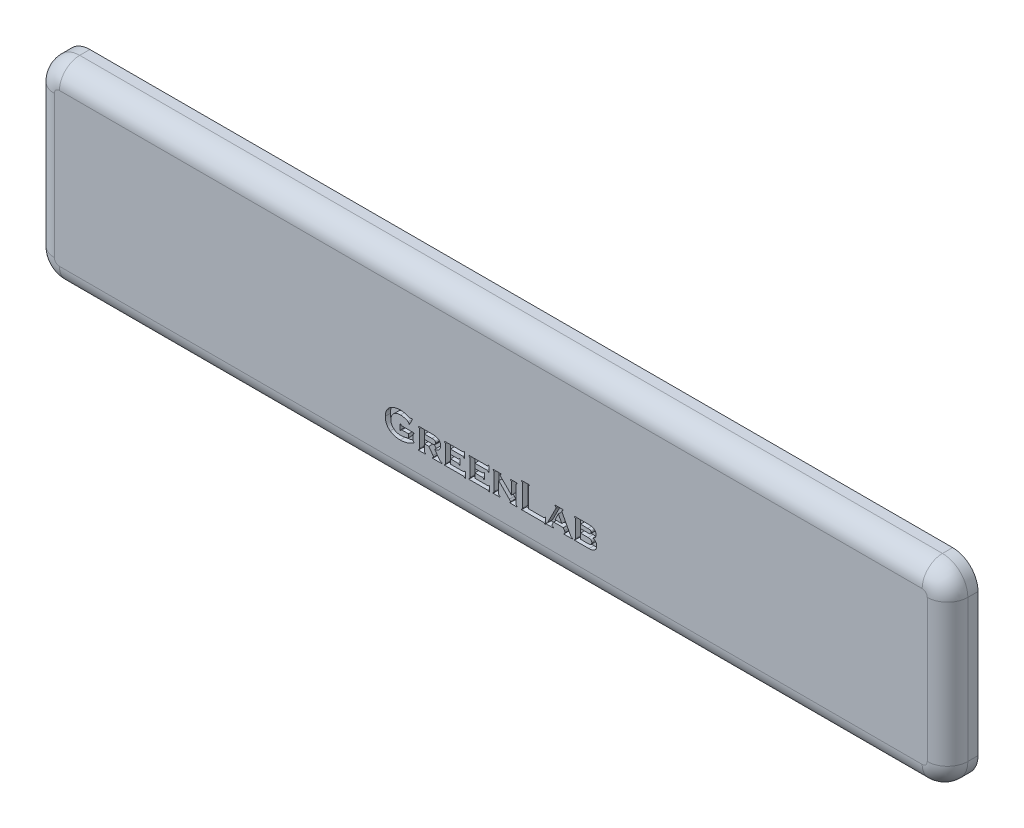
from build123d import *

# Parameters (mm, degrees)
SKETCH1_W           = 90
SKETCH1_H           = 19
BOSS_EXTRUDE1_DEPTH = 3
FILLET1_R           = 2.5
FILLET2_R           = 2
CUT_EXTRUDE1_DEPTH  = 0.5


with BuildPart() as part:
    # Sketch1 → Boss-Extrude1 (new body)
    with BuildSketch(Plane.XY.offset(3)):
        with Locations((11, 0)):
            Rectangle(SKETCH1_W, SKETCH1_H)
    extrude(amount=-BOSS_EXTRUDE1_DEPTH)

    # Fillet1
    fillet1_edges = [part.edges().sort_by_distance(p)[0] for p in [
        (-34, 9.5, 1.5),
        (56, 9.5, 1.5),
        (56, -9.5, 1.5),
        (-34, -9.5, 1.5),
    ]]
    fillet(fillet1_edges, radius=FILLET1_R)

    # Fillet2
    fillet2_edges = [part.edges().sort_by_distance(p)[0] for p in [
        (56, 0, 3),
        (-34, 0, 3),
        (11, -9.5, 3),
        (11, 9.5, 3),
        (-33.267766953, -8.767766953, 3),
        (-33.267766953, 8.767766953, 3),
        (55.267766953, -8.767766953, 3),
        (55.267766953, 8.767766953, 3),
    ]]
    fillet(fillet2_edges, radius=FILLET2_R)

    # Sketch2 → Cut-Extrude1 (cut)
    # profile 1 of 8: a face of its own
    with BuildSketch(Plane.XY.offset(3)):
        with BuildLine():
            Line((2.892361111, -4.597222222), (2.263020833, -4.597222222))
            add(Edge.make_bspline(
                [(2.263020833, -4.597222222), (2.253980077, -4.597634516), (2.236897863, -4.59841353), (2.212652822, -4.60149615), (2.192508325, -4.609463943), (2.175040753, -4.619292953), (2.161109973, -4.63393915), (2.148530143, -4.652230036), (2.137222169, -4.675071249), (2.13150657, -4.692262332), (2.128472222, -4.701388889)],
                knots=[0, 0, 0, 0, 1.161951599, 2.195469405, 3.113157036, 3.92473158, 4.744880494, 5.677977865, 6.767264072, 8, 8, 8, 8], degree=3))
            Line((2.128472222, -4.701388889), (2.059027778, -4.701388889))
            Line((2.059027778, -4.701388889), (2.059027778, -4.145833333))
            Line((2.059027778, -4.145833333), (2.128472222, -4.145833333))
            add(Edge.make_bspline(
                [(2.128472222, -4.145833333), (2.131455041, -4.155168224), (2.13702767, -4.172608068), (2.148829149, -4.195397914), (2.16035132, -4.21444602), (2.174333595, -4.228851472), (2.191430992, -4.238338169), (2.211127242, -4.24558164), (2.234709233, -4.248858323), (2.25144255, -4.249604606), (2.26030816, -4.25)],
                knots=[0, 0, 0, 0, 1.267174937, 2.367390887, 3.316236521, 4.144614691, 4.932227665, 5.829021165, 6.8497767, 8, 8, 8, 8], degree=3))
            Line((2.26030816, -4.25), (3.447916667, -4.25))
            Line((3.447916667, -4.25), (3.447916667, -4.319444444))
            add(Edge.make_bspline(
                [(3.447916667, -4.319444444), (3.438958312, -4.322276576), (3.422120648, -4.327599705), (3.399742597, -4.338767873), (3.381037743, -4.350221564), (3.366701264, -4.363946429), (3.355806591, -4.379700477), (3.349088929, -4.39859326), (3.344582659, -4.420325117), (3.344040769, -4.435880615), (3.34375, -4.444227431)],
                knots=[0, 0, 0, 0, 1.261989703, 2.371971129, 3.357346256, 4.200586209, 5.023932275, 5.909634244, 6.878345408, 8, 8, 8, 8], degree=3))
            Line((3.34375, -4.444227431), (3.34375, -4.923828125))
            add(Edge.make_bspline(
                [(3.34375, -4.923828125), (3.344110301, -4.932161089), (3.344780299, -4.947656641), (3.348455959, -4.969691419), (3.355267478, -4.988581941), (3.365562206, -5.004788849), (3.379855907, -5.01839035), (3.398945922, -5.029314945), (3.421581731, -5.040471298), (3.438775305, -5.045785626), (3.447916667, -5.048611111)],
                knots=[0, 0, 0, 0, 1.116533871, 2.076248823, 2.980572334, 3.786808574, 4.626198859, 5.59413096, 6.720864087, 8, 8, 8, 8], degree=3))
            Line((3.447916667, -5.048611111), (3.447916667, -5.118055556))
            add(Edge.make_bspline(
                [(3.447916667, -5.118055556), (3.389333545, -5.151306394), (3.274179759, -5.216665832), (3.097911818, -5.301148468), (2.9231664, -5.373083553), (2.749782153, -5.431933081), (2.577820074, -5.47792273), (2.407208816, -5.51040836), (2.237842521, -5.530912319), (2.125273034, -5.533457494), (2.069335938, -5.534722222)],
                knots=[0, 0, 0, 0, 1.109239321, 2.180373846, 3.216973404, 4.220153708, 5.194106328, 6.146335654, 7.078892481, 8, 8, 8, 8], degree=3))
            add(Edge.make_bspline(
                [(2.069335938, -5.534722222), (2.019929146, -5.533992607), (1.923451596, -5.532567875), (1.782287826, -5.51841923), (1.647967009, -5.496781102), (1.520801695, -5.464926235), (1.399922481, -5.425751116), (1.286620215, -5.37610841), (1.179736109, -5.318197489), (1.114070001, -5.272231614), (1.081380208, -5.249348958)],
                knots=[0, 0, 0, 0, 1.133031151, 2.212490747, 3.251195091, 4.25132316, 5.216867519, 6.162529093, 7.085273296, 8, 8, 8, 8], degree=3))
            add(Edge.make_bspline(
                [(1.081380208, -5.249348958), (1.061875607, -5.234168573), (1.023156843, -5.204033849), (0.968372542, -5.155928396), (0.917838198, -5.105026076), (0.870449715, -5.052718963), (0.82740661, -4.997401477), (0.788026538, -4.940094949), (0.751828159, -4.880940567), (0.720575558, -4.819179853), (0.69202152, -4.755624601), (0.667821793, -4.689559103), (0.647270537, -4.621389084), (0.629525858, -4.551271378), (0.616815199, -4.478693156), (0.607739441, -4.403891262), (0.601320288, -4.327151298), (0.600904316, -4.275150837), (0.600694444, -4.248914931)],
                knots=[0, 0, 0, 0, 1.027594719, 2.039887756, 3.02889878, 4.008719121, 4.97294883, 5.940778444, 6.898978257, 7.854104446, 8.816896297, 9.794723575, 10.777166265, 11.776613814, 12.800294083, 13.838400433, 14.909403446, 16, 16, 16, 16], degree=3))
            add(Edge.make_bspline(
                [(0.600694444, -4.248914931), (0.601836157, -4.200375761), (0.604066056, -4.105573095), (0.624688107, -3.9671466), (0.658277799, -3.83638671), (0.704809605, -3.712858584), (0.765875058, -3.597529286), (0.839325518, -3.489470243), (0.926804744, -3.389056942), (0.994039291, -3.330025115), (1.028211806, -3.300021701)],
                knots=[0, 0, 0, 0, 1.080618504, 2.110574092, 3.109061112, 4.08310081, 5.043468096, 6.008781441, 6.987946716, 8, 8, 8, 8], degree=3))
            add(Edge.make_bspline(
                [(1.028211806, -3.300021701), (1.062730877, -3.272989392), (1.132080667, -3.218680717), (1.247213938, -3.151429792), (1.369864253, -3.093483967), (1.501041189, -3.046312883), (1.640572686, -3.010151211), (1.788247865, -2.984311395), (1.944201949, -2.968332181), (2.051031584, -2.96631154), (2.105685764, -2.965277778)],
                knots=[0, 0, 0, 0, 0.913103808, 1.834451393, 2.772129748, 3.738097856, 4.735733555, 5.773315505, 6.860825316, 8, 8, 8, 8], degree=3))
            add(Edge.make_bspline(
                [(2.105685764, -2.965277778), (2.140778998, -2.965887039), (2.209950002, -2.967087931), (2.312133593, -2.973951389), (2.411161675, -2.986602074), (2.508994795, -3.004165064), (2.608495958, -3.028101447), (2.713103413, -3.058190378), (2.824018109, -3.095032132), (2.899514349, -3.123601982), (2.938476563, -3.138346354)],
                knots=[0, 0, 0, 0, 0.983904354, 1.939338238, 2.869415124, 3.781350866, 4.72455948, 5.737149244, 6.832184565, 8, 8, 8, 8], degree=3))
            add(Edge.make_bspline(
                [(2.938476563, -3.138346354), (2.957578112, -3.145777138), (2.992621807, -3.159409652), (3.041236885, -3.175251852), (3.081117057, -3.185512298), (3.104995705, -3.187428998), (3.115342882, -3.188259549)],
                knots=[0, 0, 0, 0, 1.33242011, 2.444457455, 3.325947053, 4, 4, 4, 4], degree=3))
            add(Edge.make_bspline(
                [(3.115342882, -3.188259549), (3.12210386, -3.187670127), (3.136600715, -3.186406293), (3.158314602, -3.177413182), (3.181605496, -3.164066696), (3.196688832, -3.152311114), (3.204861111, -3.14594184)],
                knots=[0, 0, 0, 0, 0.80452628, 1.72506123, 2.767418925, 4, 4, 4, 4], degree=3))
            Line((3.204861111, -3.14594184), (3.274305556, -3.173611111))
            Line((3.274305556, -3.173611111), (2.979166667, -3.772569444))
            Line((2.979166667, -3.772569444), (2.925998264, -3.744357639))
            add(Edge.make_bspline(
                [(2.925998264, -3.744357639), (2.925696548, -3.734749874), (2.925141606, -3.71707845), (2.920973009, -3.692839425), (2.916515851, -3.672707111), (2.909832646, -3.655501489), (2.898649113, -3.640532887), (2.884749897, -3.624147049), (2.865336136, -3.60707125), (2.850816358, -3.595454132), (2.842990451, -3.589192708)],
                knots=[0, 0, 0, 0, 1.244331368, 2.288680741, 3.181265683, 3.916936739, 4.658188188, 5.588746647, 6.700376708, 8, 8, 8, 8], degree=3))
            add(Edge.make_bspline(
                [(2.842990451, -3.589192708), (2.822295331, -3.574987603), (2.778307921, -3.544794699), (2.701774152, -3.506470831), (2.612004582, -3.472623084), (2.512385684, -3.441386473), (2.407875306, -3.415292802), (2.303510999, -3.396244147), (2.20199497, -3.384259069), (2.135194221, -3.382706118), (2.102430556, -3.381944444)],
                knots=[0, 0, 0, 0, 0.772448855, 1.64183753, 2.627606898, 3.725128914, 4.855858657, 5.942928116, 6.991070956, 8, 8, 8, 8], degree=3))
            add(Edge.make_bspline(
                [(2.102430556, -3.381944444), (2.070210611, -3.382493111), (2.007224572, -3.383565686), (1.914688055, -3.394233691), (1.826500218, -3.411407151), (1.742201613, -3.435338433), (1.662425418, -3.466163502), (1.586855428, -3.5041906), (1.514859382, -3.548081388), (1.471099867, -3.583445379), (1.44921875, -3.601128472)],
                knots=[0, 0, 0, 0, 1.098368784, 2.14717621, 3.171603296, 4.15934231, 5.131674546, 6.083189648, 7.041535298, 8, 8, 8, 8], degree=3))
            add(Edge.make_bspline(
                [(1.44921875, -3.601128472), (1.425714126, -3.62211143), (1.379504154, -3.66336382), (1.320080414, -3.733944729), (1.269439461, -3.808842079), (1.227678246, -3.888833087), (1.195598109, -3.973939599), (1.17312424, -4.064078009), (1.158299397, -4.15890706), (1.156942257, -4.223900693), (1.15625, -4.257052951)],
                knots=[0, 0, 0, 0, 1.016795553, 1.999014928, 2.971244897, 3.932867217, 4.907271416, 5.901990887, 6.92983762, 8, 8, 8, 8], degree=3))
            add(Edge.make_bspline(
                [(1.15625, -4.257052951), (1.156972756, -4.289300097), (1.15838448, -4.352286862), (1.172712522, -4.444381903), (1.194337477, -4.531931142), (1.226437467, -4.614534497), (1.266391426, -4.692507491), (1.316216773, -4.765299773), (1.37386815, -4.834302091), (1.419197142, -4.874636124), (1.442165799, -4.895073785)],
                knots=[0, 0, 0, 0, 1.069643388, 2.089281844, 3.086639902, 4.057689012, 5.02427436, 5.988321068, 6.980662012, 8, 8, 8, 8], degree=3))
            add(Edge.make_bspline(
                [(1.442165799, -4.895073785), (1.464434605, -4.91289434), (1.509168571, -4.948692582), (1.582803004, -4.994305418), (1.661999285, -5.032097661), (1.745783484, -5.063760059), (1.83478101, -5.088245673), (1.929033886, -5.105186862), (2.028366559, -5.116595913), (2.096429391, -5.117562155), (2.131184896, -5.118055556)],
                knots=[0, 0, 0, 0, 0.924808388, 1.857771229, 2.80254234, 3.768129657, 4.760342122, 5.792672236, 6.872853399, 8, 8, 8, 8], degree=3))
            add(Edge.make_bspline(
                [(2.131184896, -5.118055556), (2.165740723, -5.117328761), (2.234776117, -5.115876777), (2.338102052, -5.107261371), (2.440531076, -5.091751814), (2.541488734, -5.071473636), (2.638598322, -5.045732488), (2.730099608, -5.015568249), (2.814450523, -4.980503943), (2.866864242, -4.952960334), (2.892361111, -4.939561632)],
                knots=[0, 0, 0, 0, 1.05048524, 2.098652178, 3.148964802, 4.19795309, 5.227341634, 6.200829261, 7.124785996, 8, 8, 8, 8], degree=3))
            Line((2.892361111, -4.939561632), (2.892361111, -4.597222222))
        make_face()
    # profile 2 of 8: a face of its own
    with BuildSketch(Plane.XY.offset(3)):
        with BuildLine():
            Line((4.454861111, -4.666666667), (4.454861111, -5.298177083))
            add(Edge.make_bspline(
                [(4.454861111, -5.298177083), (4.455160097, -5.3068801), (4.455718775, -5.323142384), (4.460153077, -5.345995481), (4.467061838, -5.365684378), (4.476966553, -5.382897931), (4.491774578, -5.396977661), (4.510052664, -5.409747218), (4.532919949, -5.421315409), (4.549903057, -5.427326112), (4.559027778, -5.430555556)],
                knots=[0, 0, 0, 0, 1.132768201, 2.116668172, 3.018181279, 3.842213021, 4.674950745, 5.655178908, 6.740169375, 8, 8, 8, 8], degree=3))
            Line((4.559027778, -5.430555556), (4.559027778, -5.5))
            Line((4.559027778, -5.5), (3.864583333, -5.5))
            Line((3.864583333, -5.5), (3.864583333, -5.430555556))
            add(Edge.make_bspline(
                [(3.864583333, -5.430555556), (3.873527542, -5.427700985), (3.890338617, -5.422335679), (3.912846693, -5.411465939), (3.931179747, -5.399034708), (3.94552045, -5.384320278), (3.956004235, -5.366821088), (3.963583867, -5.34662627), (3.967845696, -5.323126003), (3.968435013, -5.306513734), (3.96875, -5.297634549)],
                knots=[0, 0, 0, 0, 1.214843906, 2.283358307, 3.225537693, 4.070394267, 4.922042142, 5.848661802, 6.850119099, 8, 8, 8, 8], degree=3))
            Line((3.96875, -5.297634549), (3.96875, -3.65375434))
            add(Edge.make_bspline(
                [(3.96875, -3.65375434), (3.968319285, -3.645080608), (3.967498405, -3.628549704), (3.964620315, -3.60511533), (3.95623523, -3.585706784), (3.94672628, -3.568446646), (3.931864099, -3.5546068), (3.913956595, -3.541303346), (3.890768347, -3.530258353), (3.873681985, -3.524108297), (3.864583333, -3.520833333)],
                knots=[0, 0, 0, 0, 1.128472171, 2.1507081, 3.035212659, 3.856119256, 4.685698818, 5.643135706, 6.74494729, 8, 8, 8, 8], degree=3))
            Line((3.864583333, -3.520833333), (3.864583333, -3.451388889))
            Line((3.864583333, -3.451388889), (5.194878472, -3.451388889))
            add(Edge.make_bspline(
                [(5.194878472, -3.451388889), (5.235571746, -3.451680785), (5.311747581, -3.452227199), (5.418395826, -3.456683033), (5.509437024, -3.465336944), (5.58734479, -3.476369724), (5.655785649, -3.492592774), (5.718709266, -3.513599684), (5.778069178, -3.5402276), (5.814661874, -3.562405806), (5.832899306, -3.573459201)],
                knots=[0, 0, 0, 0, 1.48188809, 2.77402262, 3.885406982, 4.811191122, 5.637019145, 6.442966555, 7.223990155, 8, 8, 8, 8], degree=3))
            add(Edge.make_bspline(
                [(5.832899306, -3.573459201), (5.850487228, -3.585794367), (5.885272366, -3.610190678), (5.930084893, -3.655479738), (5.967690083, -3.706473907), (5.998940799, -3.762743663), (6.022781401, -3.824896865), (6.040108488, -3.892585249), (6.050472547, -3.966114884), (6.051535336, -4.017037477), (6.052083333, -4.043294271)],
                knots=[0, 0, 0, 0, 0.949876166, 1.878651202, 2.806113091, 3.748939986, 4.72015234, 5.745812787, 6.837692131, 8, 8, 8, 8], degree=3))
            add(Edge.make_bspline(
                [(6.052083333, -4.043294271), (6.051684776, -4.063385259), (6.050906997, -4.102592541), (6.044326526, -4.159780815), (6.033431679, -4.213440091), (6.01909248, -4.264020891), (5.999164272, -4.310657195), (5.976016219, -4.354677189), (5.947609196, -4.394664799), (5.915166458, -4.431705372), (5.877765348, -4.465345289), (5.835796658, -4.497287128), (5.787981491, -4.52549296), (5.735286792, -4.551929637), (5.677276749, -4.575390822), (5.61417691, -4.597290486), (5.545600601, -4.616137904), (5.497846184, -4.626563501), (5.473198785, -4.631944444)],
                knots=[0, 0, 0, 0, 1.054974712, 2.05876829, 3.018077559, 3.928757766, 4.81427522, 5.67693176, 6.535972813, 7.383915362, 8.257948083, 9.17356801, 10.149288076, 11.168732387, 12.267602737, 13.433048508, 14.67512408, 16, 16, 16, 16], degree=3))
            Line((5.473198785, -4.631944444), (5.870334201, -5.167426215))
            add(Edge.make_bspline(
                [(5.870334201, -5.167426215), (5.887300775, -5.189841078), (5.918678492, -5.231294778), (5.964977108, -5.286046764), (6.004847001, -5.33021234), (6.041186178, -5.363682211), (6.07618919, -5.389052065), (6.112763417, -5.407179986), (6.150608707, -5.422659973), (6.17746429, -5.427913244), (6.190972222, -5.430555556)],
                knots=[0, 0, 0, 0, 1.583031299, 2.927633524, 4.037651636, 4.931799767, 5.706188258, 6.462410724, 7.226616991, 8, 8, 8, 8], degree=3))
            Line((6.190972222, -5.430555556), (6.190972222, -5.5))
            Line((6.190972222, -5.5), (5.265950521, -5.5))
            Line((5.265950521, -5.5), (5.265950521, -5.430555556))
            add(Edge.make_bspline(
                [(5.265950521, -5.430555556), (5.280734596, -5.42654565), (5.30718336, -5.419371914), (5.338745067, -5.400741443), (5.36184701, -5.378847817), (5.36413658, -5.360258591), (5.365234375, -5.351345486)],
                knots=[0, 0, 0, 0, 1.339679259, 2.396691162, 3.231250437, 4, 4, 4, 4], degree=3))
            add(Edge.make_bspline(
                [(5.365234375, -5.351345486), (5.364335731, -5.343828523), (5.362256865, -5.326439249), (5.34855287, -5.299381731), (5.329060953, -5.267140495), (5.311813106, -5.245183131), (5.302300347, -5.233072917)],
                knots=[0, 0, 0, 0, 0.664601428, 1.537447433, 2.641820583, 4, 4, 4, 4], degree=3))
            Line((5.302300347, -5.233072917), (4.893771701, -4.666666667))
            Line((4.893771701, -4.666666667), (4.454861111, -4.666666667))
        make_face()
        with BuildLine():
            Line((4.454861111, -4.284722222), (5.200303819, -4.284722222))
            add(Edge.make_bspline(
                [(5.200303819, -4.284722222), (5.226739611, -4.28447032), (5.276102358, -4.283999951), (5.34451607, -4.276461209), (5.402715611, -4.267240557), (5.436258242, -4.254639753), (5.451497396, -4.248914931)],
                knots=[0, 0, 0, 0, 1.241949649, 2.3190547, 3.236309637, 4, 4, 4, 4], degree=3))
            add(Edge.make_bspline(
                [(5.451497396, -4.248914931), (5.460508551, -4.244653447), (5.478108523, -4.236330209), (5.501525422, -4.219681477), (5.522401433, -4.200847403), (5.537699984, -4.177469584), (5.550635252, -4.152102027), (5.55972827, -4.123740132), (5.56528008, -4.092340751), (5.565734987, -4.070445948), (5.565972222, -4.059027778)],
                knots=[0, 0, 0, 0, 1.008207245, 1.969161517, 2.902631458, 3.838078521, 4.780680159, 5.783374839, 6.844026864, 8, 8, 8, 8], degree=3))
            add(Edge.make_bspline(
                [(5.565972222, -4.059027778), (5.565250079, -4.039371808), (5.563899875, -4.002620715), (5.548480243, -3.952232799), (5.523062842, -3.910909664), (5.492001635, -3.886021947), (5.463064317, -3.870463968), (5.436833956, -3.860833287), (5.407139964, -3.852167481), (5.373206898, -3.845208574), (5.335509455, -3.839913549), (5.293848, -3.836348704), (5.248452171, -3.833296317), (5.216766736, -3.833320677), (5.200303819, -3.833333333)],
                knots=[0, 0, 0, 0, 1.425592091, 2.665453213, 3.789359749, 4.900959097, 5.513024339, 6.175067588, 6.928547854, 7.761851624, 8.692003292, 9.695964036, 10.802883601, 12, 12, 12, 12], degree=3))
            Line((5.200303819, -3.833333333), (4.454861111, -3.833333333))
            Line((4.454861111, -3.833333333), (4.454861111, -4.284722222))
        make_face(mode=Mode.SUBTRACT)
    # profile 3 of 8: a face of its own
    with BuildSketch(Plane.XY.offset(3)):
        with BuildLine():
            Line((7.024305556, -4.666666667), (7.024305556, -5.118055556))
            Line((7.024305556, -5.118055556), (8.282443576, -5.118055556))
            add(Edge.make_bspline(
                [(8.282443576, -5.118055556), (8.291136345, -5.117687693), (8.307346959, -5.117001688), (8.330293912, -5.113422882), (8.349896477, -5.106551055), (8.366680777, -5.096130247), (8.381299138, -5.082059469), (8.393550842, -5.063190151), (8.40434504, -5.040085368), (8.410116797, -5.022999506), (8.413194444, -5.013888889)],
                knots=[0, 0, 0, 0, 1.135380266, 2.11730133, 3.020893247, 3.826673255, 4.678188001, 5.647254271, 6.745456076, 8, 8, 8, 8], degree=3))
            Line((8.413194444, -5.013888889), (8.482638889, -5.013888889))
            Line((8.482638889, -5.013888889), (8.482638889, -5.604166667))
            Line((8.482638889, -5.604166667), (8.413194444, -5.604166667))
            add(Edge.make_bspline(
                [(8.413194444, -5.604166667), (8.410565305, -5.595206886), (8.405609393, -5.578317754), (8.394616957, -5.555919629), (8.382236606, -5.537544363), (8.367562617, -5.523417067), (8.350467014, -5.512584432), (8.330330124, -5.505198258), (8.30703442, -5.500928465), (8.290600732, -5.50032138), (8.281901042, -5.5)],
                knots=[0, 0, 0, 0, 1.215074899, 2.290408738, 3.23860127, 4.08884986, 4.925925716, 5.858459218, 6.866307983, 8, 8, 8, 8], degree=3))
            Line((8.281901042, -5.5), (6.434027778, -5.5))
            Line((6.434027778, -5.5), (6.434027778, -5.430555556))
            add(Edge.make_bspline(
                [(6.434027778, -5.430555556), (6.442971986, -5.427700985), (6.459783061, -5.422335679), (6.482291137, -5.411465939), (6.500624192, -5.399034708), (6.514964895, -5.384320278), (6.525448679, -5.366821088), (6.533028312, -5.34662627), (6.53729014, -5.323126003), (6.537879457, -5.306513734), (6.538194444, -5.297634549)],
                knots=[0, 0, 0, 0, 1.214843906, 2.283358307, 3.225537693, 4.070394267, 4.922042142, 5.848661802, 6.850119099, 8, 8, 8, 8], degree=3))
            Line((6.538194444, -5.297634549), (6.538194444, -3.65375434))
            add(Edge.make_bspline(
                [(6.538194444, -3.65375434), (6.53776373, -3.645080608), (6.536942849, -3.628549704), (6.53406476, -3.60511533), (6.525679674, -3.585706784), (6.516170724, -3.568446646), (6.501308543, -3.5546068), (6.483401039, -3.541303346), (6.460212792, -3.530258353), (6.443126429, -3.524108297), (6.434027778, -3.520833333)],
                knots=[0, 0, 0, 0, 1.128472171, 2.1507081, 3.035212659, 3.856119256, 4.685698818, 5.643135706, 6.74494729, 8, 8, 8, 8], degree=3))
            Line((6.434027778, -3.520833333), (6.434027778, -3.451388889))
            Line((6.434027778, -3.451388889), (8.211914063, -3.451388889))
            add(Edge.make_bspline(
                [(8.211914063, -3.451388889), (8.220796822, -3.451084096), (8.237415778, -3.450513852), (8.260642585, -3.446169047), (8.280541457, -3.439217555), (8.297709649, -3.42909981), (8.312401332, -3.414835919), (8.324478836, -3.396087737), (8.335671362, -3.37339901), (8.340929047, -3.356362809), (8.34375, -3.347222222)],
                knots=[0, 0, 0, 0, 1.152879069, 2.156947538, 3.05581166, 3.877422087, 4.724481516, 5.688477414, 6.75977783, 8, 8, 8, 8], degree=3))
            Line((8.34375, -3.347222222), (8.413194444, -3.347222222))
            Line((8.413194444, -3.347222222), (8.413194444, -3.9375))
            Line((8.413194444, -3.9375), (8.34375, -3.9375))
            add(Edge.make_bspline(
                [(8.34375, -3.9375), (8.340884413, -3.928383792), (8.335494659, -3.911237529), (8.324809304, -3.888250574), (8.312200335, -3.869857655), (8.297753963, -3.855541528), (8.280539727, -3.845813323), (8.261084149, -3.837474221), (8.237664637, -3.834581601), (8.2211315, -3.833762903), (8.212456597, -3.833333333)],
                knots=[0, 0, 0, 0, 1.242738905, 2.33741155, 3.283964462, 4.132742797, 4.956020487, 5.843079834, 6.86826837, 8, 8, 8, 8], degree=3))
            Line((8.212456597, -3.833333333), (7.024305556, -3.833333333))
            Line((7.024305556, -3.833333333), (7.024305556, -4.284722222))
            Line((7.024305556, -4.284722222), (7.761610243, -4.284722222))
            add(Edge.make_bspline(
                [(7.761610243, -4.284722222), (7.770131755, -4.284409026), (7.786211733, -4.28381803), (7.808716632, -4.279499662), (7.8281166, -4.272577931), (7.844755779, -4.262251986), (7.859418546, -4.248202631), (7.871412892, -4.229294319), (7.883179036, -4.206708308), (7.889151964, -4.189695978), (7.892361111, -4.180555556)],
                knots=[0, 0, 0, 0, 1.117968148, 2.109590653, 2.995889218, 3.806125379, 4.662349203, 5.636774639, 6.730281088, 8, 8, 8, 8], degree=3))
            Line((7.892361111, -4.180555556), (7.961805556, -4.180555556))
            Line((7.961805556, -4.180555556), (7.961805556, -4.770833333))
            Line((7.961805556, -4.770833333), (7.892361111, -4.770833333))
            add(Edge.make_bspline(
                [(7.892361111, -4.770833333), (7.889515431, -4.761883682), (7.884166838, -4.745062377), (7.873121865, -4.722486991), (7.861003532, -4.703937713), (7.846696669, -4.689395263), (7.829976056, -4.678894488), (7.810016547, -4.671727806), (7.786914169, -4.667643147), (7.770307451, -4.667002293), (7.761610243, -4.666666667)],
                knots=[0, 0, 0, 0, 1.225527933, 2.303439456, 3.273384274, 4.108798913, 4.947881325, 5.830104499, 6.863590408, 8, 8, 8, 8], degree=3))
            Line((7.761610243, -4.666666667), (7.024305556, -4.666666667))
        make_face()
    # profile 4 of 8: a face of its own
    with BuildSketch(Plane.XY.offset(3)):
        with BuildLine():
            Line((9.420138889, -4.666666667), (9.420138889, -5.118055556))
            Line((9.420138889, -5.118055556), (10.67827691, -5.118055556))
            add(Edge.make_bspline(
                [(10.67827691, -5.118055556), (10.686969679, -5.117687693), (10.703180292, -5.117001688), (10.726127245, -5.113422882), (10.74572981, -5.106551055), (10.76251411, -5.096130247), (10.777132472, -5.082059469), (10.789384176, -5.063190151), (10.800178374, -5.040085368), (10.80595013, -5.022999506), (10.809027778, -5.013888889)],
                knots=[0, 0, 0, 0, 1.135380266, 2.11730133, 3.020893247, 3.826673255, 4.678188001, 5.647254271, 6.745456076, 8, 8, 8, 8], degree=3))
            Line((10.809027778, -5.013888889), (10.878472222, -5.013888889))
            Line((10.878472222, -5.013888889), (10.878472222, -5.604166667))
            Line((10.878472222, -5.604166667), (10.809027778, -5.604166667))
            add(Edge.make_bspline(
                [(10.809027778, -5.604166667), (10.806398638, -5.595206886), (10.801442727, -5.578317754), (10.79045029, -5.555919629), (10.77806994, -5.537544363), (10.76339595, -5.523417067), (10.746300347, -5.512584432), (10.726163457, -5.505198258), (10.702867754, -5.500928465), (10.686434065, -5.50032138), (10.677734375, -5.5)],
                knots=[0, 0, 0, 0, 1.215074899, 2.290408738, 3.23860127, 4.08884986, 4.925925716, 5.858459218, 6.866307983, 8, 8, 8, 8], degree=3))
            Line((10.677734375, -5.5), (8.829861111, -5.5))
            Line((8.829861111, -5.5), (8.829861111, -5.430555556))
            add(Edge.make_bspline(
                [(8.829861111, -5.430555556), (8.838805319, -5.427700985), (8.855616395, -5.422335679), (8.878124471, -5.411465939), (8.896457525, -5.399034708), (8.910798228, -5.384320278), (8.921282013, -5.366821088), (8.928861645, -5.34662627), (8.933123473, -5.323126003), (8.93371279, -5.306513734), (8.934027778, -5.297634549)],
                knots=[0, 0, 0, 0, 1.214843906, 2.283358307, 3.225537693, 4.070394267, 4.922042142, 5.848661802, 6.850119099, 8, 8, 8, 8], degree=3))
            Line((8.934027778, -5.297634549), (8.934027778, -3.65375434))
            add(Edge.make_bspline(
                [(8.934027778, -3.65375434), (8.933597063, -3.645080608), (8.932776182, -3.628549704), (8.929898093, -3.60511533), (8.921513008, -3.585706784), (8.912004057, -3.568446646), (8.897141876, -3.5546068), (8.879234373, -3.541303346), (8.856046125, -3.530258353), (8.838959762, -3.524108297), (8.829861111, -3.520833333)],
                knots=[0, 0, 0, 0, 1.128472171, 2.1507081, 3.035212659, 3.856119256, 4.685698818, 5.643135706, 6.74494729, 8, 8, 8, 8], degree=3))
            Line((8.829861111, -3.520833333), (8.829861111, -3.451388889))
            Line((8.829861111, -3.451388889), (10.607747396, -3.451388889))
            add(Edge.make_bspline(
                [(10.607747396, -3.451388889), (10.616630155, -3.451084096), (10.633249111, -3.450513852), (10.656475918, -3.446169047), (10.67637479, -3.439217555), (10.693542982, -3.42909981), (10.708234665, -3.414835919), (10.720312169, -3.396087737), (10.731504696, -3.37339901), (10.73676238, -3.356362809), (10.739583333, -3.347222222)],
                knots=[0, 0, 0, 0, 1.152879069, 2.156947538, 3.05581166, 3.877422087, 4.724481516, 5.688477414, 6.75977783, 8, 8, 8, 8], degree=3))
            Line((10.739583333, -3.347222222), (10.809027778, -3.347222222))
            Line((10.809027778, -3.347222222), (10.809027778, -3.9375))
            Line((10.809027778, -3.9375), (10.739583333, -3.9375))
            add(Edge.make_bspline(
                [(10.739583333, -3.9375), (10.736717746, -3.928383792), (10.731327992, -3.911237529), (10.720642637, -3.888250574), (10.708033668, -3.869857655), (10.693587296, -3.855541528), (10.676373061, -3.845813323), (10.656917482, -3.837474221), (10.63349797, -3.834581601), (10.616964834, -3.833762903), (10.608289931, -3.833333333)],
                knots=[0, 0, 0, 0, 1.242738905, 2.33741155, 3.283964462, 4.132742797, 4.956020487, 5.843079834, 6.86826837, 8, 8, 8, 8], degree=3))
            Line((10.608289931, -3.833333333), (9.420138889, -3.833333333))
            Line((9.420138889, -3.833333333), (9.420138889, -4.284722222))
            Line((9.420138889, -4.284722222), (10.157443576, -4.284722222))
            add(Edge.make_bspline(
                [(10.157443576, -4.284722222), (10.165965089, -4.284409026), (10.182045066, -4.28381803), (10.204549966, -4.279499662), (10.223949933, -4.272577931), (10.240589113, -4.262251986), (10.255251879, -4.248202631), (10.267246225, -4.229294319), (10.279012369, -4.206708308), (10.284985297, -4.189695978), (10.288194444, -4.180555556)],
                knots=[0, 0, 0, 0, 1.117968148, 2.109590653, 2.995889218, 3.806125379, 4.662349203, 5.636774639, 6.730281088, 8, 8, 8, 8], degree=3))
            Line((10.288194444, -4.180555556), (10.357638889, -4.180555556))
            Line((10.357638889, -4.180555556), (10.357638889, -4.770833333))
            Line((10.357638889, -4.770833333), (10.288194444, -4.770833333))
            add(Edge.make_bspline(
                [(10.288194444, -4.770833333), (10.285348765, -4.761883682), (10.280000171, -4.745062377), (10.268955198, -4.722486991), (10.256836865, -4.703937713), (10.242530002, -4.689395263), (10.225809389, -4.678894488), (10.20584988, -4.671727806), (10.182747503, -4.667643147), (10.166140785, -4.667002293), (10.157443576, -4.666666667)],
                knots=[0, 0, 0, 0, 1.225527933, 2.303439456, 3.273384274, 4.108798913, 4.947881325, 5.830104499, 6.863590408, 8, 8, 8, 8], degree=3))
            Line((10.157443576, -4.666666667), (9.420138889, -4.666666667))
        make_face()
    # profile 5 of 8: a face of its own
    with BuildSketch(Plane.XY.offset(3)):
        with BuildLine():
            Line((11.78125, -4.156141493), (11.78125, -5.296006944))
            add(Edge.make_bspline(
                [(11.78125, -5.296006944), (11.781544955, -5.304893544), (11.782096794, -5.321519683), (11.786594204, -5.344867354), (11.793319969, -5.365310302), (11.804126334, -5.382883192), (11.818597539, -5.397818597), (11.837278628, -5.410319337), (11.859595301, -5.421849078), (11.876458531, -5.427535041), (11.885416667, -5.430555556)],
                knots=[0, 0, 0, 0, 1.143670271, 2.139718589, 3.053348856, 3.900396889, 4.773630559, 5.710721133, 6.783882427, 8, 8, 8, 8], degree=3))
            Line((11.885416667, -5.430555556), (11.885416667, -5.5))
            Line((11.885416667, -5.5), (11.225694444, -5.5))
            Line((11.225694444, -5.5), (11.225694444, -5.430555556))
            add(Edge.make_bspline(
                [(11.225694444, -5.430555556), (11.234638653, -5.427700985), (11.251449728, -5.422335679), (11.273957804, -5.411465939), (11.292290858, -5.399034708), (11.306631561, -5.384320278), (11.317115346, -5.366821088), (11.324694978, -5.34662627), (11.328956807, -5.323126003), (11.329546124, -5.306513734), (11.329861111, -5.297634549)],
                knots=[0, 0, 0, 0, 1.214843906, 2.283358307, 3.225537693, 4.070394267, 4.922042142, 5.848661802, 6.850119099, 8, 8, 8, 8], degree=3))
            Line((11.329861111, -5.297634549), (11.329861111, -3.65375434))
            add(Edge.make_bspline(
                [(11.329861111, -3.65375434), (11.329430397, -3.645080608), (11.328609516, -3.628549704), (11.325731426, -3.60511533), (11.317346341, -3.585706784), (11.307837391, -3.568446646), (11.29297521, -3.5546068), (11.275067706, -3.541303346), (11.251879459, -3.530258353), (11.234793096, -3.524108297), (11.225694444, -3.520833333)],
                knots=[0, 0, 0, 0, 1.128472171, 2.1507081, 3.035212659, 3.856119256, 4.685698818, 5.643135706, 6.74494729, 8, 8, 8, 8], degree=3))
            Line((11.225694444, -3.520833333), (11.225694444, -3.451388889))
            Line((11.225694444, -3.451388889), (11.996636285, -3.451388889))
            Line((11.996636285, -3.451388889), (11.996636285, -3.520833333))
            add(Edge.make_bspline(
                [(11.996636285, -3.520833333), (11.984845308, -3.524290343), (11.963820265, -3.530454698), (11.937700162, -3.5458043), (11.920119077, -3.566334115), (11.918312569, -3.582760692), (11.917426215, -3.590820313)],
                knots=[0, 0, 0, 0, 1.287745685, 2.296239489, 3.164058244, 4, 4, 4, 4], degree=3))
            add(Edge.make_bspline(
                [(11.917426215, -3.590820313), (11.918315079, -3.598335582), (11.920256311, -3.614748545), (11.93229719, -3.639323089), (11.950467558, -3.665547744), (11.966344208, -3.682186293), (11.974934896, -3.691189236)],
                knots=[0, 0, 0, 0, 0.763994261, 1.668524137, 2.738463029, 4, 4, 4, 4], degree=3))
            Line((11.974934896, -3.691189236), (13.03125, -4.761067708))
            Line((13.03125, -4.761067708), (13.03125, -3.65375434))
            add(Edge.make_bspline(
                [(13.03125, -3.65375434), (13.030829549, -3.645076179), (13.030028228, -3.628536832), (13.026998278, -3.60499054), (13.01890068, -3.585263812), (13.009048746, -3.567889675), (12.994569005, -3.553515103), (12.976542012, -3.540187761), (12.953219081, -3.529765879), (12.936172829, -3.523939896), (12.927083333, -3.520833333)],
                knots=[0, 0, 0, 0, 1.125637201, 2.145305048, 3.049360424, 3.868204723, 4.712412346, 5.667443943, 6.756221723, 8, 8, 8, 8], degree=3))
            Line((12.927083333, -3.520833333), (12.927083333, -3.451388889))
            Line((12.927083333, -3.451388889), (13.586805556, -3.451388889))
            Line((13.586805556, -3.451388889), (13.586805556, -3.520833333))
            add(Edge.make_bspline(
                [(13.586805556, -3.520833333), (13.57769139, -3.52389526), (13.560753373, -3.529585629), (13.537736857, -3.540520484), (13.5193493, -3.553317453), (13.504906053, -3.567928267), (13.494821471, -3.585136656), (13.487774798, -3.605187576), (13.483602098, -3.62844821), (13.482969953, -3.645056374), (13.482638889, -3.65375434)],
                knots=[0, 0, 0, 0, 1.244751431, 2.313280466, 3.288100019, 4.132968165, 4.952453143, 5.848991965, 6.873482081, 8, 8, 8, 8], degree=3))
            Line((13.482638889, -3.65375434), (13.482638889, -5.296006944))
            add(Edge.make_bspline(
                [(13.482638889, -5.296006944), (13.482973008, -5.304703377), (13.483610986, -5.321308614), (13.487744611, -5.344588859), (13.494968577, -5.36472442), (13.504745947, -5.382265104), (13.519189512, -5.397071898), (13.538193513, -5.408984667), (13.560488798, -5.421512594), (13.577635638, -5.42740459), (13.586805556, -5.430555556)],
                knots=[0, 0, 0, 0, 1.1214246, 2.141282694, 3.033768, 3.869628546, 4.710676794, 5.667831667, 6.752785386, 8, 8, 8, 8], degree=3))
            Line((13.586805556, -5.430555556), (13.586805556, -5.5))
            Line((13.586805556, -5.5), (12.868489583, -5.5))
            Line((12.868489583, -5.5), (12.868489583, -5.430555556))
            add(Edge.make_bspline(
                [(12.868489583, -5.430555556), (12.880040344, -5.427588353), (12.900866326, -5.422238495), (12.927214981, -5.408685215), (12.944467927, -5.388616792), (12.946263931, -5.3727832), (12.947157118, -5.364908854)],
                knots=[0, 0, 0, 0, 1.28387963, 2.314830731, 3.161933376, 4, 4, 4, 4], degree=3))
            add(Edge.make_bspline(
                [(12.947157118, -5.364908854), (12.945977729, -5.356177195), (12.943409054, -5.337159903), (12.927434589, -5.3153674), (12.909411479, -5.294070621), (12.888236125, -5.271008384), (12.860370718, -5.241393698), (12.839075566, -5.219993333), (12.827256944, -5.208116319)],
                knots=[0, 0, 0, 0, 0.779058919, 1.696767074, 2.352735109, 3.293916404, 4.498147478, 6, 6, 6, 6], degree=3))
            Line((12.827256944, -5.208116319), (11.78125, -4.156141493))
        make_face()
    # profile 6 of 8: a face of its own
    with BuildSketch(Plane.XY.offset(3)):
        with BuildLine():
            Line((14.697916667, -5.083333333), (16.199110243, -5.083333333))
            add(Edge.make_bspline(
                [(16.199110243, -5.083333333), (16.207807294, -5.083008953), (16.224235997, -5.082396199), (16.247167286, -5.078236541), (16.266753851, -5.070996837), (16.283813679, -5.061225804), (16.29792818, -5.046557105), (16.3101063, -5.028076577), (16.321143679, -5.005239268), (16.326811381, -4.988287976), (16.329861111, -4.979166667)],
                knots=[0, 0, 0, 0, 1.13718709, 2.148142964, 3.030969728, 3.85821599, 4.694202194, 5.66481062, 6.743459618, 8, 8, 8, 8], degree=3))
            Line((16.329861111, -4.979166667), (16.399305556, -4.979166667))
            Line((16.399305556, -4.979166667), (16.399305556, -5.604166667))
            Line((16.399305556, -5.604166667), (16.329861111, -5.604166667))
            add(Edge.make_bspline(
                [(16.329861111, -5.604166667), (16.326766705, -5.595069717), (16.320963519, -5.578009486), (16.31043664, -5.554873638), (16.297733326, -5.536739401), (16.283852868, -5.522040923), (16.266621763, -5.512509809), (16.247204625, -5.504131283), (16.223772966, -5.501251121), (16.207241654, -5.500430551), (16.198567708, -5.5)],
                knots=[0, 0, 0, 0, 1.251925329, 2.347834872, 3.295457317, 4.12837309, 4.952581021, 5.840642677, 6.866989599, 8, 8, 8, 8], degree=3))
            Line((16.198567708, -5.5), (14.038194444, -5.5))
            Line((14.038194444, -5.5), (14.038194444, -5.430555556))
            add(Edge.make_bspline(
                [(14.038194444, -5.430555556), (14.047291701, -5.427461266), (14.064352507, -5.421658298), (14.087484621, -5.411130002), (14.105630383, -5.39843106), (14.120292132, -5.38453667), (14.130125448, -5.367060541), (14.137923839, -5.347248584), (14.141240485, -5.323593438), (14.141970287, -5.307041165), (14.142361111, -5.298177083)],
                knots=[0, 0, 0, 0, 1.245049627, 2.334940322, 3.277358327, 4.105699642, 4.925380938, 5.852235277, 6.849827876, 8, 8, 8, 8], degree=3))
            Line((14.142361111, -5.298177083), (14.142361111, -3.201822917))
            add(Edge.make_bspline(
                [(14.142361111, -3.201822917), (14.141962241, -3.192961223), (14.141217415, -3.176413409), (14.138022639, -3.152897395), (14.130021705, -3.133323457), (14.120138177, -3.115987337), (14.105839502, -3.101540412), (14.087450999, -3.088903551), (14.0643629, -3.07833133), (14.047295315, -3.072535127), (14.038194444, -3.069444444)],
                knots=[0, 0, 0, 0, 1.150912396, 2.149147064, 3.054708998, 3.874917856, 4.720532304, 5.663556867, 6.754149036, 8, 8, 8, 8], degree=3))
            Line((14.038194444, -3.069444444), (14.038194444, -3))
            Line((14.038194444, -3), (14.802083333, -3))
            Line((14.802083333, -3), (14.802083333, -3.069444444))
            add(Edge.make_bspline(
                [(14.802083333, -3.069444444), (14.792984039, -3.072343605), (14.776098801, -3.077723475), (14.752882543, -3.087966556), (14.734664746, -3.100883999), (14.719992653, -3.115514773), (14.710255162, -3.13311974), (14.70301995, -3.153236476), (14.698856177, -3.176701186), (14.698241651, -3.193487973), (14.697916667, -3.202365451)],
                knots=[0, 0, 0, 0, 1.233044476, 2.288117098, 3.259808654, 4.10196579, 4.938928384, 5.832590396, 6.853793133, 8, 8, 8, 8], degree=3))
            Line((14.697916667, -3.202365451), (14.697916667, -5.083333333))
        make_face()
    # profile 7 of 8: a face of its own
    with BuildSketch(Plane.XY.offset(3)):
        with BuildLine():
            Line((18.139756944, -4.979166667), (17.189778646, -4.979166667))
            Line((17.189778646, -4.979166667), (17.076388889, -5.19780816))
            add(Edge.make_bspline(
                [(17.076388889, -5.19780816), (17.070577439, -5.210204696), (17.059856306, -5.23307419), (17.047782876, -5.266254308), (17.039301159, -5.295039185), (17.038311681, -5.313324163), (17.037868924, -5.321506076)],
                knots=[0, 0, 0, 0, 1.258043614, 2.320875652, 3.2486483, 4, 4, 4, 4], degree=3))
            add(Edge.make_bspline(
                [(17.037868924, -5.321506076), (17.038350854, -5.328408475), (17.039279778, -5.341712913), (17.044619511, -5.3608393), (17.05490056, -5.377715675), (17.069394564, -5.392105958), (17.086870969, -5.405732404), (17.109203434, -5.415505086), (17.134769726, -5.424324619), (17.153372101, -5.428402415), (17.163194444, -5.430555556)],
                knots=[0, 0, 0, 0, 0.910861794, 1.755694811, 2.589696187, 3.483236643, 4.43677035, 5.49240796, 6.675952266, 8, 8, 8, 8], degree=3))
            Line((17.163194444, -5.430555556), (17.163194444, -5.5))
            Line((17.163194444, -5.5), (16.434027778, -5.5))
            Line((16.434027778, -5.5), (16.434027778, -5.430555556))
            add(Edge.make_bspline(
                [(16.434027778, -5.430555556), (16.444933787, -5.428634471), (16.465760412, -5.424965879), (16.49426339, -5.415954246), (16.518478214, -5.404375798), (16.539311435, -5.389559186), (16.557979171, -5.368869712), (16.577231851, -5.342229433), (16.597843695, -5.308174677), (16.611225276, -5.282706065), (16.618489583, -5.268880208)],
                knots=[0, 0, 0, 0, 1.026027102, 1.959349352, 2.761782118, 3.5064187, 4.313045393, 5.332612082, 6.551985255, 8, 8, 8, 8], degree=3))
            Line((16.618489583, -5.268880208), (17.372612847, -3.782877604))
            add(Edge.make_bspline(
                [(17.372612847, -3.782877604), (17.378969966, -3.7694069), (17.391065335, -3.743776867), (17.405131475, -3.705670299), (17.412936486, -3.669805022), (17.414291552, -3.646731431), (17.414930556, -3.635850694)],
                knots=[0, 0, 0, 0, 1.158371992, 2.203976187, 3.153055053, 4, 4, 4, 4], degree=3))
            add(Edge.make_bspline(
                [(17.414930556, -3.635850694), (17.413638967, -3.624008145), (17.411020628, -3.600000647), (17.389677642, -3.567156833), (17.355350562, -3.540572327), (17.327205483, -3.527801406), (17.311848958, -3.520833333)],
                knots=[0, 0, 0, 0, 0.861054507, 1.745550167, 2.769926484, 4, 4, 4, 4], degree=3))
            Line((17.311848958, -3.520833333), (17.311848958, -3.451388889))
            Line((17.311848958, -3.451388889), (18.109375, -3.451388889))
            Line((18.109375, -3.451388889), (18.109375, -3.520833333))
            add(Edge.make_bspline(
                [(18.109375, -3.520833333), (18.094246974, -3.527453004), (18.066138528, -3.539752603), (18.033348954, -3.56884635), (18.012023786, -3.603838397), (18.009659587, -3.629779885), (18.008463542, -3.642903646)],
                knots=[0, 0, 0, 0, 1.167592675, 2.169431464, 3.073918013, 4, 4, 4, 4], degree=3))
            add(Edge.make_bspline(
                [(18.008463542, -3.642903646), (18.008991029, -3.653451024), (18.010107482, -3.67577506), (18.020079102, -3.710532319), (18.033691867, -3.748937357), (18.047007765, -3.774702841), (18.054036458, -3.788302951)],
                knots=[0, 0, 0, 0, 0.821800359, 1.739380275, 2.806749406, 4, 4, 4, 4], degree=3))
            Line((18.054036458, -3.788302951), (18.826605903, -5.229275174))
            add(Edge.make_bspline(
                [(18.826605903, -5.229275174), (18.836633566, -5.247232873), (18.854932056, -5.280002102), (18.881087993, -5.323693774), (18.904536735, -5.356669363), (18.925317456, -5.381422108), (18.947707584, -5.399353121), (18.973996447, -5.411725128), (19.003973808, -5.423871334), (19.026322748, -5.42823669), (19.038194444, -5.430555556)],
                knots=[0, 0, 0, 0, 1.613020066, 2.94344076, 3.990283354, 4.784068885, 5.470665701, 6.219068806, 7.053974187, 8, 8, 8, 8], degree=3))
            Line((19.038194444, -5.430555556), (19.038194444, -5.5))
            Line((19.038194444, -5.5), (18.1875, -5.5))
            Line((18.1875, -5.5), (18.1875, -5.430555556))
            add(Edge.make_bspline(
                [(18.1875, -5.430555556), (18.196778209, -5.428789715), (18.21432341, -5.42545049), (18.238424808, -5.417295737), (18.258902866, -5.407095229), (18.27554808, -5.394306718), (18.28914655, -5.379502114), (18.298221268, -5.361857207), (18.304003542, -5.342303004), (18.304454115, -5.328602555), (18.3046875, -5.321506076)],
                knots=[0, 0, 0, 0, 1.280586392, 2.42160363, 3.442514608, 4.370371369, 5.257057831, 6.146457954, 7.039913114, 8, 8, 8, 8], degree=3))
            add(Edge.make_bspline(
                [(18.3046875, -5.321506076), (18.304129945, -5.311686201), (18.302933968, -5.290622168), (18.293238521, -5.257691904), (18.278677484, -5.221554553), (18.26552331, -5.197144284), (18.258572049, -5.184244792)],
                knots=[0, 0, 0, 0, 0.804870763, 1.726480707, 2.798569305, 4, 4, 4, 4], degree=3))
            Line((18.258572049, -5.184244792), (18.139756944, -4.979166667))
        make_face()
        Polygon((17.994357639, -4.701388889), (17.655815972, -4.046006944), (17.329210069, -4.701388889), align=None, mode=Mode.SUBTRACT)
    # profile 8 of 8: a face of its own
    with BuildSketch(Plane.XY.offset(3)):
        with BuildLine():
            add(Edge.make_bspline(
                [(21.073784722, -4.399739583), (21.097643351, -4.410989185), (21.142611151, -4.43219199), (21.203527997, -4.466984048), (21.254862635, -4.501276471), (21.283442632, -4.526751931), (21.296766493, -4.538628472)],
                knots=[0, 0, 0, 0, 1.199284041, 2.260363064, 3.188989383, 4, 4, 4, 4], degree=3))
            add(Edge.make_bspline(
                [(21.296766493, -4.538628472), (21.307685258, -4.549797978), (21.329533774, -4.572148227), (21.357737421, -4.609592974), (21.380996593, -4.650283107), (21.400928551, -4.693106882), (21.415332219, -4.739355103), (21.426235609, -4.78813901), (21.432843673, -4.839917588), (21.433627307, -4.875342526), (21.434027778, -4.893446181)],
                knots=[0, 0, 0, 0, 0.957204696, 1.915372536, 2.864513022, 3.827290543, 4.805779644, 5.828215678, 6.89012558, 8, 8, 8, 8], degree=3))
            add(Edge.make_bspline(
                [(21.434027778, -4.893446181), (21.433485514, -4.917720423), (21.432428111, -4.96505464), (21.421763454, -5.034000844), (21.404776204, -5.098795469), (21.379794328, -5.159040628), (21.349147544, -5.215409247), (21.310325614, -5.26679032), (21.265336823, -5.314590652), (21.230422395, -5.341835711), (21.212673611, -5.355685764)],
                knots=[0, 0, 0, 0, 1.09149512, 2.128390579, 3.131133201, 4.098244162, 5.056171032, 6.009871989, 6.988316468, 8, 8, 8, 8], degree=3))
            add(Edge.make_bspline(
                [(21.212673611, -5.355685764), (21.195720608, -5.367273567), (21.161255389, -5.390831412), (21.104398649, -5.419658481), (21.043566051, -5.444938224), (20.97780638, -5.464584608), (20.907843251, -5.481420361), (20.832748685, -5.491377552), (20.753305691, -5.499077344), (20.698733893, -5.499686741), (20.670681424, -5.5)],
                knots=[0, 0, 0, 0, 0.863665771, 1.755820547, 2.677628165, 3.63366667, 4.641991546, 5.703604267, 6.819544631, 8, 8, 8, 8], degree=3))
            Line((20.670681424, -5.5), (19.246527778, -5.5))
            Line((19.246527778, -5.5), (19.246527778, -5.430555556))
            add(Edge.make_bspline(
                [(19.246527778, -5.430555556), (19.255471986, -5.427700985), (19.272283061, -5.422335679), (19.294791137, -5.411465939), (19.313124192, -5.399034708), (19.327464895, -5.384320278), (19.337948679, -5.366821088), (19.345528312, -5.34662627), (19.34979014, -5.323126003), (19.350379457, -5.306513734), (19.350694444, -5.297634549)],
                knots=[0, 0, 0, 0, 1.214843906, 2.283358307, 3.225537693, 4.070394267, 4.922042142, 5.848661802, 6.850119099, 8, 8, 8, 8], degree=3))
            Line((19.350694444, -5.297634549), (19.350694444, -3.65375434))
            add(Edge.make_bspline(
                [(19.350694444, -3.65375434), (19.35026373, -3.645080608), (19.349442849, -3.628549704), (19.34656476, -3.60511533), (19.338179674, -3.585706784), (19.328670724, -3.568446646), (19.313808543, -3.5546068), (19.295901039, -3.541303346), (19.272712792, -3.530258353), (19.255626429, -3.524108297), (19.246527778, -3.520833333)],
                knots=[0, 0, 0, 0, 1.128472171, 2.1507081, 3.035212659, 3.856119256, 4.685698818, 5.643135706, 6.74494729, 8, 8, 8, 8], degree=3))
            Line((19.246527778, -3.520833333), (19.246527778, -3.451388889))
            Line((19.246527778, -3.451388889), (20.644097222, -3.451388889))
            add(Edge.make_bspline(
                [(20.644097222, -3.451388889), (20.673770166, -3.451758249), (20.731022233, -3.452470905), (20.813775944, -3.45923484), (20.890469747, -3.469246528), (20.961193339, -3.483495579), (21.025524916, -3.503225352), (21.083783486, -3.52657171), (21.13685089, -3.55318807), (21.167738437, -3.575915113), (21.182834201, -3.587022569)],
                knots=[0, 0, 0, 0, 1.259531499, 2.430186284, 3.522538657, 4.541950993, 5.489154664, 6.374533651, 7.205580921, 8, 8, 8, 8], degree=3))
            add(Edge.make_bspline(
                [(21.182834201, -3.587022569), (21.197437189, -3.599160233), (21.226134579, -3.623012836), (21.263196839, -3.664169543), (21.294406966, -3.708505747), (21.320010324, -3.756058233), (21.340467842, -3.806924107), (21.354098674, -3.861344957), (21.36332541, -3.91892122), (21.364156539, -3.958439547), (21.364583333, -3.978732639)],
                knots=[0, 0, 0, 0, 1.01613969, 1.996889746, 2.956405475, 3.914354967, 4.883989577, 5.884961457, 6.913904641, 8, 8, 8, 8], degree=3))
            add(Edge.make_bspline(
                [(21.364583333, -3.978732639), (21.364051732, -4.002136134), (21.363033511, -4.046962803), (21.34983918, -4.110768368), (21.330452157, -4.168567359), (21.300432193, -4.220265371), (21.26018638, -4.267403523), (21.209431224, -4.313436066), (21.146154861, -4.357961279), (21.098797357, -4.385300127), (21.073784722, -4.399739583)],
                knots=[0, 0, 0, 0, 1.030855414, 1.974483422, 2.862815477, 3.710022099, 4.593755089, 5.587821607, 6.725968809, 8, 8, 8, 8], degree=3))
        make_face()
        with BuildLine():
            Line((19.836805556, -4.215277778), (20.563802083, -4.215277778))
            add(Edge.make_bspline(
                [(20.563802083, -4.215277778), (20.590416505, -4.214869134), (20.63963178, -4.21411347), (20.707028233, -4.206065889), (20.762426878, -4.194048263), (20.806204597, -4.17495674), (20.839992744, -4.14850172), (20.862622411, -4.113095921), (20.87659936, -4.07053043), (20.877823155, -4.039616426), (20.878472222, -4.023220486)],
                knots=[0, 0, 0, 0, 1.51097798, 2.794094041, 3.850547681, 4.719436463, 5.486328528, 6.249910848, 7.071800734, 8, 8, 8, 8], degree=3))
            add(Edge.make_bspline(
                [(20.878472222, -4.023220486), (20.877784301, -4.007019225), (20.876497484, -3.976713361), (20.863176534, -3.934684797), (20.840488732, -3.900257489), (20.807085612, -3.874051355), (20.763426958, -3.855244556), (20.708042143, -3.842262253), (20.640150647, -3.834589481), (20.590589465, -3.833774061), (20.563802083, -3.833333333)],
                knots=[0, 0, 0, 0, 0.921773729, 1.724257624, 2.482423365, 3.237988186, 4.110479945, 5.17376898, 6.472447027, 8, 8, 8, 8], degree=3))
            Line((20.563802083, -3.833333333), (19.836805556, -3.833333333))
            Line((19.836805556, -3.833333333), (19.836805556, -4.215277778))
        make_face(mode=Mode.SUBTRACT)
        with BuildLine():
            Line((19.836805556, -5.118055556), (20.585503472, -5.118055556))
            add(Edge.make_bspline(
                [(20.585503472, -5.118055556), (20.613935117, -5.117232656), (20.66710476, -5.115693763), (20.741601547, -5.104278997), (20.804700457, -5.083815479), (20.857569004, -5.055781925), (20.898434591, -5.01790871), (20.927598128, -4.971570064), (20.945480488, -4.917132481), (20.947081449, -4.878035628), (20.947916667, -4.857638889)],
                knots=[0, 0, 0, 0, 1.34516632, 2.515577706, 3.551944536, 4.47115753, 5.324827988, 6.155678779, 7.037821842, 8, 8, 8, 8], degree=3))
            add(Edge.make_bspline(
                [(20.947916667, -4.857638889), (20.947138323, -4.837040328), (20.945659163, -4.797894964), (20.927276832, -4.743534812), (20.898832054, -4.69682567), (20.857173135, -4.659689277), (20.805026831, -4.630565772), (20.741379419, -4.611442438), (20.667218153, -4.598623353), (20.613961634, -4.597710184), (20.585503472, -4.597222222)],
                knots=[0, 0, 0, 0, 0.97017498, 1.843713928, 2.681349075, 3.528750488, 4.451635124, 5.484788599, 6.655971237, 8, 8, 8, 8], degree=3))
            Line((20.585503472, -4.597222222), (19.836805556, -4.597222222))
            Line((19.836805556, -4.597222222), (19.836805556, -5.118055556))
        make_face(mode=Mode.SUBTRACT)
    extrude(amount=-CUT_EXTRUDE1_DEPTH, mode=Mode.SUBTRACT)


solid = part.part
